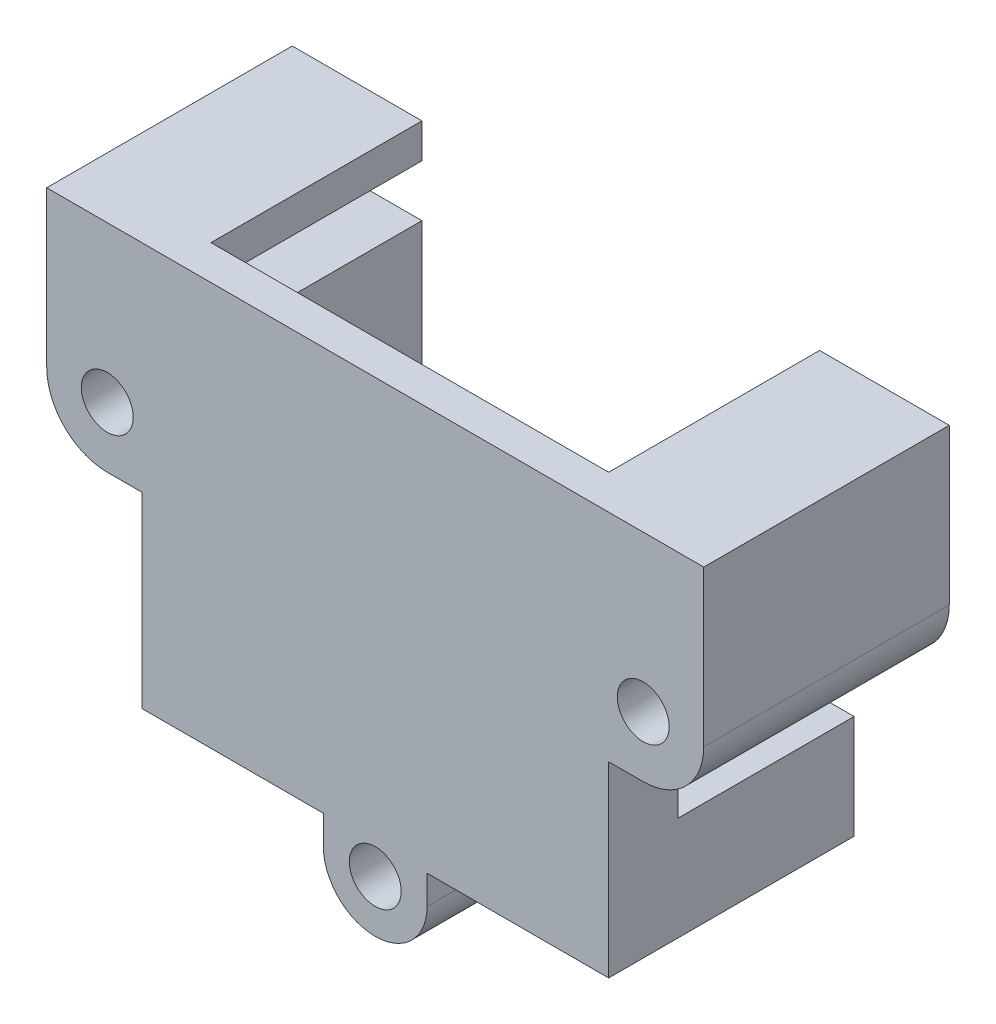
from build123d import *
from build123d.topology import SkipClean

# Parameters (mm, degrees)
CROQUIS1_R                 = 1
SALIENTE_EXTRUIR1_DEPTH    = 8
SALIENTE_EXTRUIR1_2_DEPTH  = 8
CROQUIS3_R                 = 1
SALIENTE_EXTRUIR2_DEPTH    = 2
CROQUIS5_W                 = 2
CROQUIS5_H                 = 3.333333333
SALIENTE_EXTRUIR3_DEPTH    = 2
SALIENTE_EXTRUIR4_START    = 4.2
SALIENTE_EXTRUIR4_DEPTH    = 4.2
SALIENTE_EXTRUIR7_DEPTH    = 14.2
SALIENTE_EXTRUIR8_DEPTH    = 14.2
CORTAR_EXTRUIR3_DEPTH      = 33.69388322
CORTAR_EXTRUIR3_DEPTH_BACK = 33.69388322
CROQUIS10_R                = 1.5


with BuildPart() as part:
    # Croquis1 → Saliente-Extruir1 (new body)
    with BuildSketch(Plane.XY):
        with BuildLine():
            Line((11.5, 17.5), (11.5, 8.5))
            Line((11.5, 8.5), (13.5, 8.5))
            Line((13.5, 8.5), (13.5, 11.5))
            Line((13.5, 11.5), (15.5, 11.5))
            ThreePointArc((15.5, 11.5), (16.914213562, 12.085786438), (17.5, 13.5))
            Line((17.5, 13.5), (17.5, 15.5))
            Line((17.5, 15.5), (19, 15.5))
            Line((19, 15.5), (19, 20.5))
            Line((19, 20.5), (19, 22.5))
            Line((19, 22.5), (11.5, 22.5))
            Line((11.5, 22.5), (11.5, 20.5))
            Line((11.5, 20.5), (17, 20.5))
            Line((17, 20.5), (17, 17.5))
            Line((17, 17.5), (11.5, 17.5))
        make_face()
        with Locations((15.5, 13.5)):
            Circle(CROQUIS1_R, mode=Mode.SUBTRACT)
    extrude(amount=SALIENTE_EXTRUIR1_DEPTH)



with BuildPart() as body_2:
    # Croquis1 → Saliente-Extruir1 2 (new body)
    with BuildSketch(Plane.XY):
        with BuildLine():
            Line((-17, 17.5), (-17, 20.5))
            Line((-17, 20.5), (-11.5, 20.5))
            Line((-11.5, 20.5), (-11.5, 22.5))
            Line((-11.5, 22.5), (-19, 22.5))
            Line((-19, 22.5), (-19, 20.5))
            Line((-19, 20.5), (-19, 15.5))
            Line((-19, 15.5), (-17.5, 15.5))
            Line((-17.5, 15.5), (-17.5, 13.5))
            ThreePointArc((-17.5, 13.5), (-16.914213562, 12.085786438), (-15.5, 11.5))
            Line((-15.5, 11.5), (-13.5, 11.5))
            Line((-13.5, 11.5), (-13.5, -0.833333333))
            Line((-13.5, -0.833333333), (-1.885618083, -0.833333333))
            ThreePointArc((-1.885618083, -0.833333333), (0, -3.5), (1.885618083, -0.833333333))
            Line((1.885618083, -0.833333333), (13.5, -0.833333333))
            Line((13.5, -0.833333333), (13.5, 5.166666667))
            Line((13.5, 5.166666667), (11.5, 5.166666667))
            Line((11.5, 5.166666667), (11.5, 0.5))
            Line((11.5, 0.5), (-11.5, 0.5))
            Line((-11.5, 0.5), (-11.5, 17.5))
            Line((-11.5, 17.5), (-17, 17.5))
        make_face()
        with Locations((0, -1.5)):
            Circle(CROQUIS1_R, mode=Mode.SUBTRACT)
        with Locations((-15.5, 13.5)):
            Circle(CROQUIS1_R, mode=Mode.SUBTRACT)
    extrude(amount=SALIENTE_EXTRUIR1_2_DEPTH)


with BuildPart() as part_1:
    add(part.part)

    add(body_2.part)  # Saliente-Extruir2 merges body 2
    # Croquis3 → Saliente-Extruir2 (add)
    with BuildSketch(Plane.XY.offset(8)):
        with BuildLine():
            Line((19, 22.5), (11.5, 22.5))
            Line((11.5, 22.5), (-11.5, 22.5))
            Line((-11.5, 22.5), (-19, 22.5))
            Line((-19, 22.5), (-19, 15.5))
            Line((-19, 15.5), (-17.5, 15.5))
            Line((-17.5, 15.5), (-17.5, 13.5))
            ThreePointArc((-17.5, 13.5), (-16.914213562, 12.085786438), (-15.5, 11.5))
            Line((-15.5, 11.5), (-13.5, 11.5))
            Line((-13.5, 11.5), (-13.5, -0.833333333))
            Line((-13.5, -0.833333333), (-1.885618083, -0.833333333))
            ThreePointArc((-1.885618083, -0.833333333), (0, -3.5), (1.885618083, -0.833333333))
            Line((1.885618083, -0.833333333), (13.5, -0.833333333))
            Line((13.5, -0.833333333), (13.5, 5.166666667))
            Line((13.5, 5.166666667), (13.5, 8.5))
            Line((13.5, 8.5), (13.5, 11.5))
            Line((13.5, 11.5), (15.5, 11.5))
            ThreePointArc((15.5, 11.5), (16.914213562, 12.085786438), (17.5, 13.5))
            Line((17.5, 13.5), (17.5, 15.5))
            Line((17.5, 15.5), (19, 15.5))
            Line((19, 15.5), (19, 22.5))
        make_face()
        with Locations((15.5, 13.5)):
            Circle(CROQUIS3_R, mode=Mode.SUBTRACT)
        with Locations((0, -1.5)):
            Circle(CROQUIS3_R, mode=Mode.SUBTRACT)
        with Locations((-15.5, 13.5)):
            Circle(CROQUIS3_R, mode=Mode.SUBTRACT)
    extrude(amount=SALIENTE_EXTRUIR2_DEPTH)

    # Croquis5 → Saliente-Extruir3 (add)
    with BuildSketch(Plane(origin=(0, 0, 8), x_dir=(-1, 0, 0), z_dir=(0, 0, -1))):
        with Locations((-12.5, 6.833333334)):
            Rectangle(CROQUIS5_W, CROQUIS5_H)
    extrude(amount=SALIENTE_EXTRUIR3_DEPTH)

    # Croquis6 → Saliente-Extruir4 (add)
    with SkipClean():  # the faces are left unmerged after this step: merging them gives an invalid solid
        with BuildSketch(Plane(origin=(0, 0, 0), x_dir=(-1, 0, 0), z_dir=(0, 0, -1)).offset(SALIENTE_EXTRUIR4_START)):
            with BuildLine():
                Line((17, 17.5), (11.5, 17.5))
                Line((11.5, 17.5), (11.5, 0.5))
                Line((11.5, 0.5), (-11.5, 0.5))
                Line((-11.5, 0.5), (-11.5, 5.166666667))
                Line((-11.5, 5.166666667), (-13.5, 5.166666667))
                Line((-13.5, 5.166666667), (-13.5, -0.833333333))
                Line((-13.5, -0.833333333), (-1.885618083, -0.833333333))
                ThreePointArc((-1.885618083, -0.833333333), (0, -3.5), (1.885618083, -0.833333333))
                Line((1.885618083, -0.833333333), (13.5, -0.833333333))
                Line((13.5, -0.833333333), (13.5, 11.5))
                Line((13.5, 11.5), (15.5, 11.5))
                ThreePointArc((15.5, 11.5), (16.914213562, 12.085786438), (17.5, 13.5))
                Line((17.5, 13.5), (17.5, 15.5))
                Line((17.5, 15.5), (19, 15.5))
                Line((19, 15.5), (19, 22.5))
                Line((19, 22.5), (11.5, 22.5))
                Line((11.5, 22.5), (11.5, 20.5))
                Line((11.5, 20.5), (17, 20.5))
                Line((17, 20.5), (17, 17.5))
            make_face()
            with BuildLine():
                Line((-11.5, 17.5), (-17, 17.5))
                Line((-17, 17.5), (-17, 20.5))
                Line((-17, 20.5), (-11.5, 20.5))
                Line((-11.5, 20.5), (-11.5, 22.5))
                Line((-11.5, 22.5), (-19, 22.5))
                Line((-19, 22.5), (-19, 15.5))
                Line((-19, 15.5), (-17.5, 15.5))
                Line((-17.5, 15.5), (-17.5, 13.5))
                ThreePointArc((-17.5, 13.5), (-16.914213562, 12.085786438), (-15.5, 11.5))
                Line((-15.5, 11.5), (-13.5, 11.5))
                Line((-13.5, 11.5), (-13.5, 8.5))
                Line((-13.5, 8.5), (-11.5, 8.5))
                Line((-11.5, 8.5), (-11.5, 17.5))
            make_face()
        extrude(amount=-SALIENTE_EXTRUIR4_DEPTH)

    # Croquis7 → Saliente-Extruir7 (add)
    with SkipClean():  # the faces are left unmerged after this step: merging them gives an invalid solid
        with BuildSketch(Plane(origin=(0, 0, -4.2), x_dir=(-1, 0, 0), z_dir=(0, 0, -1))):
            with BuildLine():
                Line((-19, 13.5), (-19, 15.5))
                Line((-19, 15.5), (-18.372281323, 15.5))
                ThreePointArc((-18.372281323, 15.5), (-13.025126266, 15.974873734), (-13.5, 10.627718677))
                Line((-13.5, 10.627718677), (-13.5, 10))
                Line((-13.5, 10), (-15.5, 10))
                ThreePointArc((-15.5, 10), (-17.974873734, 11.025126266), (-19, 13.5))
            make_face()
            with BuildLine():
                Line((13.5, 10), (13.5, 10.627718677))
                ThreePointArc((13.5, 10.627718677), (13.025126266, 15.974873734), (18.372281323, 15.5))
                Line((18.372281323, 15.5), (19, 15.5))
                Line((19, 15.5), (19, 13.5))
                ThreePointArc((19, 13.5), (17.974873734, 11.025126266), (15.5, 10))
                Line((15.5, 10), (13.5, 10))
            make_face()
        extrude(amount=-SALIENTE_EXTRUIR7_DEPTH)

    # Croquis9 → Saliente-Extruir8 (add)
    with BuildSketch(Plane(origin=(0, 0, -4.2), x_dir=(-1, 0, 0), z_dir=(0, 0, -1))):
        with BuildLine():
            Line((-3, -2.5), (-3, 0.5))
            Line((-3, 0.5), (3, 0.5))
            Line((3, 0.5), (3, -2.5))
            ThreePointArc((3, -2.5), (0, -5.5), (-3, -2.5))
        make_face()
    extrude(amount=-SALIENTE_EXTRUIR8_DEPTH)

    # Croquis10 → Cortar-Extruir3 (cut, two sides: drawn at the far end of the back side and taken through both)
    with BuildSketch(Plane(origin=(0, 0, -4.2), x_dir=(-1, 0, 0), z_dir=(0, 0, -1)).offset(-CORTAR_EXTRUIR3_DEPTH_BACK)):
        with Locations((-15.5, 13.5)):
            Circle(CROQUIS10_R)
        with Locations((0, -2.5)):
            Circle(CROQUIS10_R)
        with Locations((15.5, 13.5)):
            Circle(CROQUIS10_R)
    extrude(amount=CORTAR_EXTRUIR3_DEPTH + CORTAR_EXTRUIR3_DEPTH_BACK, mode=Mode.SUBTRACT)


solid = part_1.part
